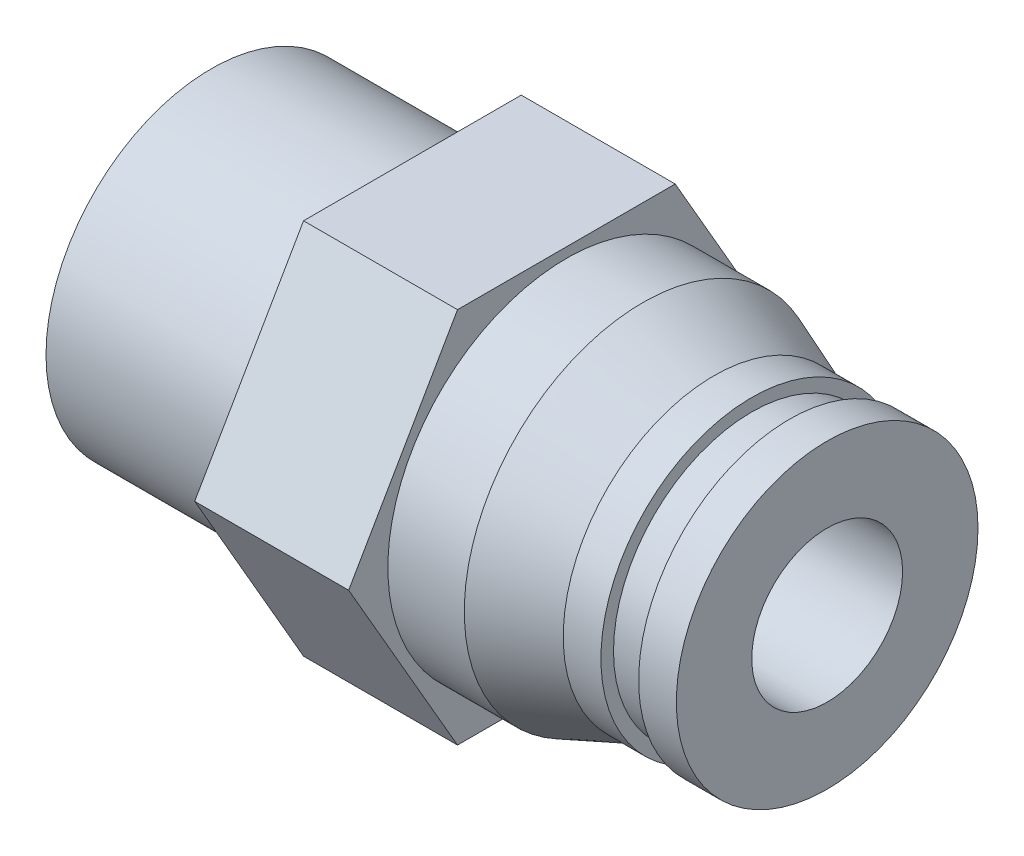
ISO-10303-21;
HEADER;
FILE_DESCRIPTION(('STEP AP214'),'2;1');
FILE_NAME('part.step','',(''),(''),'','','');
FILE_SCHEMA(('AUTOMOTIVE_DESIGN { 1 0 10303 214 1 1 1 1 }'));
ENDSEC;
DATA;
#1=APPLICATION_CONTEXT('core data for automotive mechanical design processes');
#2=APPLICATION_PROTOCOL_DEFINITION('international standard','automotive_design',2000,#1);
#3=PRODUCT_CONTEXT('',#1,'mechanical');
#4=PRODUCT('Part','Part','',(#3));
#5=PRODUCT_RELATED_PRODUCT_CATEGORY('part','',(#4));
#6=PRODUCT_DEFINITION_FORMATION('','',#4);
#7=PRODUCT_DEFINITION_CONTEXT('part definition',#1,'design');
#8=PRODUCT_DEFINITION('design','',#6,#7);
#9=PRODUCT_DEFINITION_SHAPE('','',#8);
#10=(LENGTH_UNIT() NAMED_UNIT(*) SI_UNIT(.MILLI.,.METRE.));
#11=(NAMED_UNIT(*) PLANE_ANGLE_UNIT() SI_UNIT($,.RADIAN.));
#12=(NAMED_UNIT(*) SI_UNIT($,.STERADIAN.) SOLID_ANGLE_UNIT());
#13=UNCERTAINTY_MEASURE_WITH_UNIT(LENGTH_MEASURE(1.E-05),#10,'distance_accuracy_value','');
#14=(GEOMETRIC_REPRESENTATION_CONTEXT(3) GLOBAL_UNCERTAINTY_ASSIGNED_CONTEXT((#13)) GLOBAL_UNIT_ASSIGNED_CONTEXT((#10,
#11,#12)) REPRESENTATION_CONTEXT('',''));
#15=CARTESIAN_POINT('',(0.,0.,0.));
#16=DIRECTION('',(0.,0.,1.));
#17=DIRECTION('',(1.,0.,0.));
#18=AXIS2_PLACEMENT_3D('',#15,#16,#17);
#19=CARTESIAN_POINT('',(8.,6.575,0.));
#20=DIRECTION('',(-1.,0.,0.));
#21=DIRECTION('',(0.,0.,1.));
#22=AXIS2_PLACEMENT_3D('',#19,#20,#21);
#23=PLANE('',#22);
#24=CARTESIAN_POINT('',(8.,0.,0.));
#25=DIRECTION('',(1.,0.,0.));
#26=DIRECTION('',(0.,0.,-1.));
#27=AXIS2_PLACEMENT_3D('',#24,#25,#26);
#28=CIRCLE('',#27,6.575);
#29=CARTESIAN_POINT('',(8.,0.,-6.575));
#30=VERTEX_POINT('',#29);
#31=EDGE_CURVE('E215',#30,#30,#28,.T.);
#32=ORIENTED_EDGE('',*,*,#31,.T.);
#33=EDGE_LOOP('',(#32));
#34=FACE_BOUND('',#33,.T.);
#35=DIRECTION('',(0.,-0.866025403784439,0.5));
#36=VECTOR('',#35,1.);
#37=CARTESIAN_POINT('',(8.,0.,-8.66025403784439));
#38=LINE('',#37,#36);
#39=CARTESIAN_POINT('',(8.,0.,-8.66025403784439));
#40=VERTEX_POINT('',#39);
#41=CARTESIAN_POINT('',(8.,-7.5,-4.33012701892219));
#42=VERTEX_POINT('',#41);
#43=EDGE_CURVE('E121',#40,#42,#38,.T.);
#44=ORIENTED_EDGE('',*,*,#43,.T.);
#45=DIRECTION('',(0.,0.,1.));
#46=VECTOR('',#45,1.);
#47=CARTESIAN_POINT('',(8.,-7.5,-4.33012701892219));
#48=LINE('',#47,#46);
#49=CARTESIAN_POINT('',(8.,-7.5,4.3301270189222));
#50=VERTEX_POINT('',#49);
#51=EDGE_CURVE('E106',#42,#50,#48,.T.);
#52=ORIENTED_EDGE('',*,*,#51,.T.);
#53=DIRECTION('',(0.,0.866025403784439,0.5));
#54=VECTOR('',#53,1.);
#55=CARTESIAN_POINT('',(8.,-7.5,4.3301270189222));
#56=LINE('',#55,#54);
#57=CARTESIAN_POINT('',(8.,0.,8.66025403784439));
#58=VERTEX_POINT('',#57);
#59=EDGE_CURVE('E115',#50,#58,#56,.T.);
#60=ORIENTED_EDGE('',*,*,#59,.T.);
#61=DIRECTION('',(0.,0.866025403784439,-0.5));
#62=VECTOR('',#61,1.);
#63=CARTESIAN_POINT('',(8.,0.,8.66025403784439));
#64=LINE('',#63,#62);
#65=CARTESIAN_POINT('',(8.,7.5,4.33012701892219));
#66=VERTEX_POINT('',#65);
#67=EDGE_CURVE('E30',#58,#66,#64,.T.);
#68=ORIENTED_EDGE('',*,*,#67,.T.);
#69=DIRECTION('',(0.,0.,-1.));
#70=VECTOR('',#69,1.);
#71=CARTESIAN_POINT('',(8.,7.5,4.33012701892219));
#72=LINE('',#71,#70);
#73=CARTESIAN_POINT('',(8.,7.5,-4.3301270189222));
#74=VERTEX_POINT('',#73);
#75=EDGE_CURVE('E125',#66,#74,#72,.T.);
#76=ORIENTED_EDGE('',*,*,#75,.T.);
#77=DIRECTION('',(0.,-0.866025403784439,-0.5));
#78=VECTOR('',#77,1.);
#79=CARTESIAN_POINT('',(8.,7.5,-4.3301270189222));
#80=LINE('',#79,#78);
#81=EDGE_CURVE('E128',#74,#40,#80,.T.);
#82=ORIENTED_EDGE('',*,*,#81,.T.);
#83=EDGE_LOOP('',(#44,#52,#60,#68,#76,#82));
#84=FACE_BOUND('',#83,.T.);
#85=ADVANCED_FACE('F15',(#34,#84),#23,.T.);
#86=CARTESIAN_POINT('',(14.125,9.5,0.));
#87=DIRECTION('',(1.,0.,0.));
#88=DIRECTION('',(0.,0.,-1.));
#89=AXIS2_PLACEMENT_3D('',#86,#87,#88);
#90=PLANE('',#89);
#91=CARTESIAN_POINT('',(14.125,0.,0.));
#92=DIRECTION('',(1.,0.,0.));
#93=DIRECTION('',(0.,0.,-1.));
#94=AXIS2_PLACEMENT_3D('',#91,#92,#93);
#95=CIRCLE('',#94,7.1009788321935);
#96=CARTESIAN_POINT('',(14.125,0.,-7.1009788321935));
#97=VERTEX_POINT('',#96);
#98=EDGE_CURVE('E212',#97,#97,#95,.T.);
#99=ORIENTED_EDGE('',*,*,#98,.F.);
#100=EDGE_LOOP('',(#99));
#101=FACE_BOUND('',#100,.T.);
#102=DIRECTION('',(0.,0.866025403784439,0.5));
#103=VECTOR('',#102,1.);
#104=CARTESIAN_POINT('',(14.125,-7.5,4.3301270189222));
#105=LINE('',#104,#103);
#106=CARTESIAN_POINT('',(14.125,-7.5,4.3301270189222));
#107=VERTEX_POINT('',#106);
#108=CARTESIAN_POINT('',(14.125,0.,8.66025403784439));
#109=VERTEX_POINT('',#108);
#110=EDGE_CURVE('E132',#107,#109,#105,.T.);
#111=ORIENTED_EDGE('',*,*,#110,.F.);
#112=DIRECTION('',(0.,0.,1.));
#113=VECTOR('',#112,1.);
#114=CARTESIAN_POINT('',(14.125,-7.5,-4.33012701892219));
#115=LINE('',#114,#113);
#116=CARTESIAN_POINT('',(14.125,-7.5,-4.33012701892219));
#117=VERTEX_POINT('',#116);
#118=EDGE_CURVE('E38',#117,#107,#115,.T.);
#119=ORIENTED_EDGE('',*,*,#118,.F.);
#120=DIRECTION('',(0.,-0.866025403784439,0.5));
#121=VECTOR('',#120,1.);
#122=CARTESIAN_POINT('',(14.125,0.,-8.66025403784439));
#123=LINE('',#122,#121);
#124=CARTESIAN_POINT('',(14.125,0.,-8.66025403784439));
#125=VERTEX_POINT('',#124);
#126=EDGE_CURVE('E112',#125,#117,#123,.T.);
#127=ORIENTED_EDGE('',*,*,#126,.F.);
#128=DIRECTION('',(0.,-0.866025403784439,-0.5));
#129=VECTOR('',#128,1.);
#130=CARTESIAN_POINT('',(14.125,7.5,-4.3301270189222));
#131=LINE('',#130,#129);
#132=CARTESIAN_POINT('',(14.125,7.5,-4.3301270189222));
#133=VERTEX_POINT('',#132);
#134=EDGE_CURVE('E140',#133,#125,#131,.T.);
#135=ORIENTED_EDGE('',*,*,#134,.F.);
#136=DIRECTION('',(0.,0.,-1.));
#137=VECTOR('',#136,1.);
#138=CARTESIAN_POINT('',(14.125,7.5,4.33012701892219));
#139=LINE('',#138,#137);
#140=CARTESIAN_POINT('',(14.125,7.5,4.33012701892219));
#141=VERTEX_POINT('',#140);
#142=EDGE_CURVE('E137',#141,#133,#139,.T.);
#143=ORIENTED_EDGE('',*,*,#142,.F.);
#144=DIRECTION('',(0.,0.866025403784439,-0.5));
#145=VECTOR('',#144,1.);
#146=CARTESIAN_POINT('',(14.125,0.,8.66025403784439));
#147=LINE('',#146,#145);
#148=EDGE_CURVE('E134',#109,#141,#147,.T.);
#149=ORIENTED_EDGE('',*,*,#148,.F.);
#150=EDGE_LOOP('',(#111,#119,#127,#135,#143,#149));
#151=FACE_BOUND('',#150,.T.);
#152=ADVANCED_FACE('F269',(#101,#151),#90,.T.);
#153=CARTESIAN_POINT('',(0.,0.,0.));
#154=DIRECTION('',(-1.,0.,0.));
#155=DIRECTION('',(0.,0.,1.));
#156=AXIS2_PLACEMENT_3D('',#153,#154,#155);
#157=PLANE('',#156);
#158=CARTESIAN_POINT('',(0.,0.,0.));
#159=DIRECTION('',(1.,0.,0.));
#160=DIRECTION('',(0.,0.,-1.));
#161=AXIS2_PLACEMENT_3D('',#158,#159,#160);
#162=CIRCLE('',#161,6.575);
#163=CARTESIAN_POINT('',(0.,0.,-6.575));
#164=VERTEX_POINT('',#163);
#165=EDGE_CURVE('E218',#164,#164,#162,.T.);
#166=ORIENTED_EDGE('',*,*,#165,.F.);
#167=EDGE_LOOP('',(#166));
#168=FACE_BOUND('',#167,.T.);
#169=DIRECTION('',(0.,-0.866025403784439,-0.5));
#170=VECTOR('',#169,1.);
#171=CARTESIAN_POINT('',(0.,0.,2.88675134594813));
#172=LINE('',#171,#170);
#173=CARTESIAN_POINT('',(0.,0.,2.88675134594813));
#174=VERTEX_POINT('',#173);
#175=CARTESIAN_POINT('',(0.,-2.5,1.44337567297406));
#176=VERTEX_POINT('',#175);
#177=EDGE_CURVE('E169',#174,#176,#172,.T.);
#178=ORIENTED_EDGE('',*,*,#177,.T.);
#179=DIRECTION('',(0.,0.,-1.));
#180=VECTOR('',#179,1.);
#181=CARTESIAN_POINT('',(0.,-2.5,1.44337567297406));
#182=LINE('',#181,#180);
#183=CARTESIAN_POINT('',(0.,-2.5,-1.44337567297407));
#184=VERTEX_POINT('',#183);
#185=EDGE_CURVE('E147',#176,#184,#182,.T.);
#186=ORIENTED_EDGE('',*,*,#185,.T.);
#187=DIRECTION('',(0.,0.866025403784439,-0.5));
#188=VECTOR('',#187,1.);
#189=CARTESIAN_POINT('',(0.,-2.5,-1.44337567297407));
#190=LINE('',#189,#188);
#191=CARTESIAN_POINT('',(0.,0.,-2.88675134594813));
#192=VERTEX_POINT('',#191);
#193=EDGE_CURVE('E157',#184,#192,#190,.T.);
#194=ORIENTED_EDGE('',*,*,#193,.T.);
#195=DIRECTION('',(0.,0.866025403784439,0.5));
#196=VECTOR('',#195,1.);
#197=CARTESIAN_POINT('',(0.,0.,-2.88675134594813));
#198=LINE('',#197,#196);
#199=CARTESIAN_POINT('',(0.,2.5,-1.44337567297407));
#200=VERTEX_POINT('',#199);
#201=EDGE_CURVE('E160',#192,#200,#198,.T.);
#202=ORIENTED_EDGE('',*,*,#201,.T.);
#203=DIRECTION('',(0.,0.,1.));
#204=VECTOR('',#203,1.);
#205=CARTESIAN_POINT('',(0.,2.5,-1.44337567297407));
#206=LINE('',#205,#204);
#207=CARTESIAN_POINT('',(0.,2.5,1.44337567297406));
#208=VERTEX_POINT('',#207);
#209=EDGE_CURVE('E163',#200,#208,#206,.T.);
#210=ORIENTED_EDGE('',*,*,#209,.T.);
#211=DIRECTION('',(0.,-0.866025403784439,0.5));
#212=VECTOR('',#211,1.);
#213=CARTESIAN_POINT('',(0.,2.5,1.44337567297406));
#214=LINE('',#213,#212);
#215=EDGE_CURVE('E166',#208,#174,#214,.T.);
#216=ORIENTED_EDGE('',*,*,#215,.T.);
#217=EDGE_LOOP('',(#178,#186,#194,#202,#210,#216));
#218=FACE_BOUND('',#217,.T.);
#219=ADVANCED_FACE('F17',(#168,#218),#157,.T.);
#220=CARTESIAN_POINT('',(8.,3.,0.));
#221=DIRECTION('',(1.,0.,0.));
#222=DIRECTION('',(0.,0.,-1.));
#223=AXIS2_PLACEMENT_3D('',#220,#221,#222);
#224=PLANE('',#223);
#225=CARTESIAN_POINT('',(8.,0.,0.));
#226=DIRECTION('',(1.,0.,0.));
#227=DIRECTION('',(0.,0.,-1.));
#228=AXIS2_PLACEMENT_3D('',#225,#226,#227);
#229=CIRCLE('',#228,3.);
#230=CARTESIAN_POINT('',(8.,0.,-3.));
#231=VERTEX_POINT('',#230);
#232=EDGE_CURVE('E185',#231,#231,#229,.T.);
#233=ORIENTED_EDGE('',*,*,#232,.T.);
#234=EDGE_LOOP('',(#233));
#235=FACE_BOUND('',#234,.T.);
#236=DIRECTION('',(0.,-0.866025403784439,0.5));
#237=VECTOR('',#236,1.);
#238=CARTESIAN_POINT('',(8.,1.,-3.46410161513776));
#239=LINE('',#238,#237);
#240=CARTESIAN_POINT('',(8.,0.,-2.88675134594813));
#241=VERTEX_POINT('',#240);
#242=CARTESIAN_POINT('',(8.,-2.5,-1.44337567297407));
#243=VERTEX_POINT('',#242);
#244=EDGE_CURVE('E23',#241,#243,#239,.T.);
#245=ORIENTED_EDGE('',*,*,#244,.T.);
#246=DIRECTION('',(0.,0.,1.));
#247=VECTOR('',#246,1.);
#248=CARTESIAN_POINT('',(8.,-2.5,0.));
#249=LINE('',#248,#247);
#250=CARTESIAN_POINT('',(8.,-2.5,1.44337567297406));
#251=VERTEX_POINT('',#250);
#252=EDGE_CURVE('E9',#243,#251,#249,.T.);
#253=ORIENTED_EDGE('',*,*,#252,.T.);
#254=DIRECTION('',(0.,0.866025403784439,0.5));
#255=VECTOR('',#254,1.);
#256=CARTESIAN_POINT('',(8.,1.,3.46410161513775));
#257=LINE('',#256,#255);
#258=CARTESIAN_POINT('',(8.,0.,2.88675134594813));
#259=VERTEX_POINT('',#258);
#260=EDGE_CURVE('E221',#251,#259,#257,.T.);
#261=ORIENTED_EDGE('',*,*,#260,.T.);
#262=DIRECTION('',(0.,0.866025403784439,-0.5));
#263=VECTOR('',#262,1.);
#264=CARTESIAN_POINT('',(8.,3.5,0.866025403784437));
#265=LINE('',#264,#263);
#266=CARTESIAN_POINT('',(8.,2.5,1.44337567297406));
#267=VERTEX_POINT('',#266);
#268=EDGE_CURVE('E224',#259,#267,#265,.T.);
#269=ORIENTED_EDGE('',*,*,#268,.T.);
#270=DIRECTION('',(0.,0.,-1.));
#271=VECTOR('',#270,1.);
#272=CARTESIAN_POINT('',(8.,2.5,0.));
#273=LINE('',#272,#271);
#274=CARTESIAN_POINT('',(8.,2.5,-1.44337567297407));
#275=VERTEX_POINT('',#274);
#276=EDGE_CURVE('E227',#267,#275,#273,.T.);
#277=ORIENTED_EDGE('',*,*,#276,.T.);
#278=DIRECTION('',(0.,-0.866025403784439,-0.5));
#279=VECTOR('',#278,1.);
#280=CARTESIAN_POINT('',(8.,3.5,-0.866025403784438));
#281=LINE('',#280,#279);
#282=EDGE_CURVE('E230',#275,#241,#281,.T.);
#283=ORIENTED_EDGE('',*,*,#282,.T.);
#284=EDGE_LOOP('',(#245,#253,#261,#269,#277,#283));
#285=FACE_BOUND('',#284,.T.);
#286=ADVANCED_FACE('F234',(#235,#285),#224,.T.);
#287=CARTESIAN_POINT('',(0.,0.,0.));
#288=DIRECTION('',(1.,0.,0.));
#289=DIRECTION('',(0.,0.,-1.));
#290=AXIS2_PLACEMENT_3D('',#287,#288,#289);
#291=CYLINDRICAL_SURFACE('',#290,6.575);
#292=ORIENTED_EDGE('',*,*,#165,.T.);
#293=EDGE_LOOP('',(#292));
#294=FACE_BOUND('',#293,.T.);
#295=ORIENTED_EDGE('',*,*,#31,.F.);
#296=EDGE_LOOP('',(#295));
#297=FACE_BOUND('',#296,.T.);
#298=ADVANCED_FACE('F278',(#294,#297),#291,.T.);
#299=CARTESIAN_POINT('',(0.,0.,0.));
#300=DIRECTION('',(1.,0.,0.));
#301=DIRECTION('',(0.,0.,-1.));
#302=AXIS2_PLACEMENT_3D('',#299,#300,#301);
#303=CYLINDRICAL_SURFACE('',#302,7.1009788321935);
#304=ORIENTED_EDGE('',*,*,#98,.T.);
#305=EDGE_LOOP('',(#304));
#306=FACE_BOUND('',#305,.T.);
#307=CARTESIAN_POINT('',(17.1656620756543,0.,0.));
#308=DIRECTION('',(1.,0.,0.));
#309=DIRECTION('',(0.,0.,-1.));
#310=AXIS2_PLACEMENT_3D('',#307,#308,#309);
#311=CIRCLE('',#310,7.1009788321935);
#312=CARTESIAN_POINT('',(17.1656620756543,0.,-7.1009788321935));
#313=VERTEX_POINT('',#312);
#314=EDGE_CURVE('E209',#313,#313,#311,.T.);
#315=ORIENTED_EDGE('',*,*,#314,.F.);
#316=EDGE_LOOP('',(#315));
#317=FACE_BOUND('',#316,.T.);
#318=ADVANCED_FACE('F280',(#306,#317),#303,.T.);
#319=CARTESIAN_POINT('',(20.,0.,0.));
#320=DIRECTION('',(-1.,0.,0.));
#321=DIRECTION('',(0.,0.,1.));
#322=AXIS2_PLACEMENT_3D('',#319,#320,#321);
#323=CONICAL_SURFACE('',#322,6.,0.370503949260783);
#324=ORIENTED_EDGE('',*,*,#314,.T.);
#325=EDGE_LOOP('',(#324));
#326=FACE_BOUND('',#325,.T.);
#327=CARTESIAN_POINT('',(20.,0.,0.));
#328=DIRECTION('',(1.,0.,0.));
#329=DIRECTION('',(0.,0.,-1.));
#330=AXIS2_PLACEMENT_3D('',#327,#328,#329);
#331=CIRCLE('',#330,6.);
#332=CARTESIAN_POINT('',(20.,0.,-6.));
#333=VERTEX_POINT('',#332);
#334=EDGE_CURVE('E206',#333,#333,#331,.T.);
#335=ORIENTED_EDGE('',*,*,#334,.F.);
#336=EDGE_LOOP('',(#335));
#337=FACE_BOUND('',#336,.T.);
#338=ADVANCED_FACE('F286',(#326,#337),#323,.T.);
#339=CARTESIAN_POINT('',(0.,0.,0.));
#340=DIRECTION('',(1.,0.,0.));
#341=DIRECTION('',(0.,0.,-1.));
#342=AXIS2_PLACEMENT_3D('',#339,#340,#341);
#343=CYLINDRICAL_SURFACE('',#342,6.);
#344=ORIENTED_EDGE('',*,*,#334,.T.);
#345=EDGE_LOOP('',(#344));
#346=FACE_BOUND('',#345,.T.);
#347=CARTESIAN_POINT('',(21.5,0.,0.));
#348=DIRECTION('',(1.,0.,0.));
#349=DIRECTION('',(0.,0.,-1.));
#350=AXIS2_PLACEMENT_3D('',#347,#348,#349);
#351=CIRCLE('',#350,6.);
#352=CARTESIAN_POINT('',(21.5,0.,-6.));
#353=VERTEX_POINT('',#352);
#354=EDGE_CURVE('E203',#353,#353,#351,.T.);
#355=ORIENTED_EDGE('',*,*,#354,.F.);
#356=EDGE_LOOP('',(#355));
#357=FACE_BOUND('',#356,.T.);
#358=ADVANCED_FACE('F330',(#346,#357),#343,.T.);
#359=CARTESIAN_POINT('',(21.5,6.,0.));
#360=DIRECTION('',(1.,0.,0.));
#361=DIRECTION('',(0.,0.,-1.));
#362=AXIS2_PLACEMENT_3D('',#359,#360,#361);
#363=PLANE('',#362);
#364=ORIENTED_EDGE('',*,*,#354,.T.);
#365=EDGE_LOOP('',(#364));
#366=FACE_BOUND('',#365,.T.);
#367=CARTESIAN_POINT('',(21.5,0.,0.));
#368=DIRECTION('',(1.,0.,0.));
#369=DIRECTION('',(0.,0.,-1.));
#370=AXIS2_PLACEMENT_3D('',#367,#368,#369);
#371=CIRCLE('',#370,5.5);
#372=CARTESIAN_POINT('',(21.5,0.,-5.5));
#373=VERTEX_POINT('',#372);
#374=EDGE_CURVE('E200',#373,#373,#371,.T.);
#375=ORIENTED_EDGE('',*,*,#374,.F.);
#376=EDGE_LOOP('',(#375));
#377=FACE_BOUND('',#376,.T.);
#378=ADVANCED_FACE('F340',(#366,#377),#363,.T.);
#379=CARTESIAN_POINT('',(0.,0.,0.));
#380=DIRECTION('',(1.,0.,0.));
#381=DIRECTION('',(0.,0.,-1.));
#382=AXIS2_PLACEMENT_3D('',#379,#380,#381);
#383=CYLINDRICAL_SURFACE('',#382,5.5);
#384=ORIENTED_EDGE('',*,*,#374,.T.);
#385=EDGE_LOOP('',(#384));
#386=FACE_BOUND('',#385,.T.);
#387=CARTESIAN_POINT('',(23.,0.,0.));
#388=DIRECTION('',(1.,0.,0.));
#389=DIRECTION('',(0.,0.,-1.));
#390=AXIS2_PLACEMENT_3D('',#387,#388,#389);
#391=CIRCLE('',#390,5.5);
#392=CARTESIAN_POINT('',(23.,0.,-5.5));
#393=VERTEX_POINT('',#392);
#394=EDGE_CURVE('E197',#393,#393,#391,.T.);
#395=ORIENTED_EDGE('',*,*,#394,.F.);
#396=EDGE_LOOP('',(#395));
#397=FACE_BOUND('',#396,.T.);
#398=ADVANCED_FACE('F350',(#386,#397),#383,.T.);
#399=CARTESIAN_POINT('',(23.,5.5,0.));
#400=DIRECTION('',(-1.,0.,0.));
#401=DIRECTION('',(0.,0.,1.));
#402=AXIS2_PLACEMENT_3D('',#399,#400,#401);
#403=PLANE('',#402);
#404=ORIENTED_EDGE('',*,*,#394,.T.);
#405=EDGE_LOOP('',(#404));
#406=FACE_BOUND('',#405,.T.);
#407=CARTESIAN_POINT('',(23.,0.,0.));
#408=DIRECTION('',(1.,0.,0.));
#409=DIRECTION('',(0.,0.,-1.));
#410=AXIS2_PLACEMENT_3D('',#407,#408,#409);
#411=CIRCLE('',#410,6.);
#412=CARTESIAN_POINT('',(23.,0.,-6.));
#413=VERTEX_POINT('',#412);
#414=EDGE_CURVE('E194',#413,#413,#411,.T.);
#415=ORIENTED_EDGE('',*,*,#414,.F.);
#416=EDGE_LOOP('',(#415));
#417=FACE_BOUND('',#416,.T.);
#418=ADVANCED_FACE('F361',(#406,#417),#403,.T.);
#419=CARTESIAN_POINT('',(0.,0.,0.));
#420=DIRECTION('',(1.,0.,0.));
#421=DIRECTION('',(0.,0.,-1.));
#422=AXIS2_PLACEMENT_3D('',#419,#420,#421);
#423=CYLINDRICAL_SURFACE('',#422,6.);
#424=ORIENTED_EDGE('',*,*,#414,.T.);
#425=EDGE_LOOP('',(#424));
#426=FACE_BOUND('',#425,.T.);
#427=CARTESIAN_POINT('',(24.5,0.,0.));
#428=DIRECTION('',(1.,0.,0.));
#429=DIRECTION('',(0.,0.,-1.));
#430=AXIS2_PLACEMENT_3D('',#427,#428,#429);
#431=CIRCLE('',#430,6.);
#432=CARTESIAN_POINT('',(24.5,0.,-6.));
#433=VERTEX_POINT('',#432);
#434=EDGE_CURVE('E191',#433,#433,#431,.T.);
#435=ORIENTED_EDGE('',*,*,#434,.F.);
#436=EDGE_LOOP('',(#435));
#437=FACE_BOUND('',#436,.T.);
#438=ADVANCED_FACE('F375',(#426,#437),#423,.T.);
#439=CARTESIAN_POINT('',(24.5,6.,0.));
#440=DIRECTION('',(1.,0.,0.));
#441=DIRECTION('',(0.,0.,-1.));
#442=AXIS2_PLACEMENT_3D('',#439,#440,#441);
#443=PLANE('',#442);
#444=ORIENTED_EDGE('',*,*,#434,.T.);
#445=EDGE_LOOP('',(#444));
#446=FACE_BOUND('',#445,.T.);
#447=CARTESIAN_POINT('',(24.5,0.,0.));
#448=DIRECTION('',(1.,0.,0.));
#449=DIRECTION('',(0.,0.,-1.));
#450=AXIS2_PLACEMENT_3D('',#447,#448,#449);
#451=CIRCLE('',#450,3.);
#452=CARTESIAN_POINT('',(24.5,0.,-3.));
#453=VERTEX_POINT('',#452);
#454=EDGE_CURVE('E188',#453,#453,#451,.T.);
#455=ORIENTED_EDGE('',*,*,#454,.F.);
#456=EDGE_LOOP('',(#455));
#457=FACE_BOUND('',#456,.T.);
#458=ADVANCED_FACE('F385',(#446,#457),#443,.T.);
#459=CARTESIAN_POINT('',(0.,0.,0.));
#460=DIRECTION('',(1.,0.,0.));
#461=DIRECTION('',(0.,0.,-1.));
#462=AXIS2_PLACEMENT_3D('',#459,#460,#461);
#463=CYLINDRICAL_SURFACE('',#462,3.);
#464=ORIENTED_EDGE('',*,*,#454,.T.);
#465=EDGE_LOOP('',(#464));
#466=FACE_BOUND('',#465,.T.);
#467=ORIENTED_EDGE('',*,*,#232,.F.);
#468=EDGE_LOOP('',(#467));
#469=FACE_BOUND('',#468,.T.);
#470=ADVANCED_FACE('F396',(#466,#469),#463,.F.);
#471=CARTESIAN_POINT('',(24.5,-2.5,1.44337567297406));
#472=DIRECTION('',(0.,1.,0.));
#473=DIRECTION('',(0.,0.,1.));
#474=AXIS2_PLACEMENT_3D('',#471,#472,#473);
#475=PLANE('',#474);
#476=DIRECTION('',(-1.,0.,0.));
#477=VECTOR('',#476,1.);
#478=CARTESIAN_POINT('',(24.5,-2.5,-1.44337567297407));
#479=LINE('',#478,#477);
#480=EDGE_CURVE('E183',#243,#184,#479,.T.);
#481=ORIENTED_EDGE('',*,*,#480,.T.);
#482=ORIENTED_EDGE('',*,*,#185,.F.);
#483=DIRECTION('',(-1.,0.,0.));
#484=VECTOR('',#483,1.);
#485=CARTESIAN_POINT('',(24.5,-2.5,1.44337567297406));
#486=LINE('',#485,#484);
#487=EDGE_CURVE('E172',#251,#176,#486,.T.);
#488=ORIENTED_EDGE('',*,*,#487,.F.);
#489=ORIENTED_EDGE('',*,*,#252,.F.);
#490=EDGE_LOOP('',(#481,#482,#488,#489));
#491=FACE_BOUND('',#490,.T.);
#492=ADVANCED_FACE('F249',(#491),#475,.T.);
#493=CARTESIAN_POINT('',(24.5,-2.5,-1.44337567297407));
#494=DIRECTION('',(0.,0.5,0.866025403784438));
#495=DIRECTION('',(0.,-0.866025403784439,0.5));
#496=AXIS2_PLACEMENT_3D('',#493,#494,#495);
#497=PLANE('',#496);
#498=DIRECTION('',(-1.,0.,0.));
#499=VECTOR('',#498,1.);
#500=CARTESIAN_POINT('',(24.5,0.,-2.88675134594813));
#501=LINE('',#500,#499);
#502=EDGE_CURVE('E181',#241,#192,#501,.T.);
#503=ORIENTED_EDGE('',*,*,#502,.T.);
#504=ORIENTED_EDGE('',*,*,#193,.F.);
#505=ORIENTED_EDGE('',*,*,#480,.F.);
#506=ORIENTED_EDGE('',*,*,#244,.F.);
#507=EDGE_LOOP('',(#503,#504,#505,#506));
#508=FACE_BOUND('',#507,.T.);
#509=ADVANCED_FACE('F238',(#508),#497,.T.);
#510=CARTESIAN_POINT('',(24.5,0.,-2.88675134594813));
#511=DIRECTION('',(0.,-0.5,0.866025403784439));
#512=DIRECTION('',(0.,-0.866025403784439,-0.5));
#513=AXIS2_PLACEMENT_3D('',#510,#511,#512);
#514=PLANE('',#513);
#515=DIRECTION('',(-1.,0.,0.));
#516=VECTOR('',#515,1.);
#517=CARTESIAN_POINT('',(24.5,2.5,-1.44337567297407));
#518=LINE('',#517,#516);
#519=EDGE_CURVE('E179',#275,#200,#518,.T.);
#520=ORIENTED_EDGE('',*,*,#519,.T.);
#521=ORIENTED_EDGE('',*,*,#201,.F.);
#522=ORIENTED_EDGE('',*,*,#502,.F.);
#523=ORIENTED_EDGE('',*,*,#282,.F.);
#524=EDGE_LOOP('',(#520,#521,#522,#523));
#525=FACE_BOUND('',#524,.T.);
#526=ADVANCED_FACE('F242',(#525),#514,.T.);
#527=CARTESIAN_POINT('',(24.5,2.5,-1.44337567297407));
#528=DIRECTION('',(0.,-1.,0.));
#529=DIRECTION('',(0.,0.,-1.));
#530=AXIS2_PLACEMENT_3D('',#527,#528,#529);
#531=PLANE('',#530);
#532=DIRECTION('',(-1.,0.,0.));
#533=VECTOR('',#532,1.);
#534=CARTESIAN_POINT('',(24.5,2.5,1.44337567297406));
#535=LINE('',#534,#533);
#536=EDGE_CURVE('E177',#267,#208,#535,.T.);
#537=ORIENTED_EDGE('',*,*,#536,.T.);
#538=ORIENTED_EDGE('',*,*,#209,.F.);
#539=ORIENTED_EDGE('',*,*,#519,.F.);
#540=ORIENTED_EDGE('',*,*,#276,.F.);
#541=EDGE_LOOP('',(#537,#538,#539,#540));
#542=FACE_BOUND('',#541,.T.);
#543=ADVANCED_FACE('F258',(#542),#531,.T.);
#544=CARTESIAN_POINT('',(24.5,2.5,1.44337567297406));
#545=DIRECTION('',(0.,-0.5,-0.866025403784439));
#546=DIRECTION('',(0.,0.866025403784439,-0.5));
#547=AXIS2_PLACEMENT_3D('',#544,#545,#546);
#548=PLANE('',#547);
#549=DIRECTION('',(-1.,0.,0.));
#550=VECTOR('',#549,1.);
#551=CARTESIAN_POINT('',(24.5,0.,2.88675134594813));
#552=LINE('',#551,#550);
#553=EDGE_CURVE('E175',#259,#174,#552,.T.);
#554=ORIENTED_EDGE('',*,*,#553,.T.);
#555=ORIENTED_EDGE('',*,*,#215,.F.);
#556=ORIENTED_EDGE('',*,*,#536,.F.);
#557=ORIENTED_EDGE('',*,*,#268,.F.);
#558=EDGE_LOOP('',(#554,#555,#556,#557));
#559=FACE_BOUND('',#558,.T.);
#560=ADVANCED_FACE('F255',(#559),#548,.T.);
#561=CARTESIAN_POINT('',(24.5,0.,2.88675134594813));
#562=DIRECTION('',(0.,0.5,-0.866025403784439));
#563=DIRECTION('',(0.,0.866025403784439,0.5));
#564=AXIS2_PLACEMENT_3D('',#561,#562,#563);
#565=PLANE('',#564);
#566=ORIENTED_EDGE('',*,*,#487,.T.);
#567=ORIENTED_EDGE('',*,*,#177,.F.);
#568=ORIENTED_EDGE('',*,*,#553,.F.);
#569=ORIENTED_EDGE('',*,*,#260,.F.);
#570=EDGE_LOOP('',(#566,#567,#568,#569));
#571=FACE_BOUND('',#570,.T.);
#572=ADVANCED_FACE('F251',(#571),#565,.T.);
#573=CARTESIAN_POINT('',(14.125,-7.5,-4.33012701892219));
#574=DIRECTION('',(0.,-1.,0.));
#575=DIRECTION('',(0.,0.,-1.));
#576=AXIS2_PLACEMENT_3D('',#573,#574,#575);
#577=PLANE('',#576);
#578=DIRECTION('',(-1.,0.,0.));
#579=VECTOR('',#578,1.);
#580=CARTESIAN_POINT('',(14.125,-7.5,-4.33012701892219));
#581=LINE('',#580,#579);
#582=EDGE_CURVE('E145',#117,#42,#581,.T.);
#583=ORIENTED_EDGE('',*,*,#582,.F.);
#584=ORIENTED_EDGE('',*,*,#118,.T.);
#585=DIRECTION('',(-1.,0.,0.));
#586=VECTOR('',#585,1.);
#587=CARTESIAN_POINT('',(14.125,-7.5,4.3301270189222));
#588=LINE('',#587,#586);
#589=EDGE_CURVE('E102',#107,#50,#588,.T.);
#590=ORIENTED_EDGE('',*,*,#589,.T.);
#591=ORIENTED_EDGE('',*,*,#51,.F.);
#592=EDGE_LOOP('',(#583,#584,#590,#591));
#593=FACE_BOUND('',#592,.T.);
#594=ADVANCED_FACE('F104',(#593),#577,.T.);
#595=CARTESIAN_POINT('',(14.125,0.,-8.66025403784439));
#596=DIRECTION('',(0.,-0.5,-0.866025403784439));
#597=DIRECTION('',(0.,0.866025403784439,-0.5));
#598=AXIS2_PLACEMENT_3D('',#595,#596,#597);
#599=PLANE('',#598);
#600=DIRECTION('',(-1.,0.,0.));
#601=VECTOR('',#600,1.);
#602=CARTESIAN_POINT('',(14.125,0.,-8.66025403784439));
#603=LINE('',#602,#601);
#604=EDGE_CURVE('E148',#125,#40,#603,.T.);
#605=ORIENTED_EDGE('',*,*,#604,.F.);
#606=ORIENTED_EDGE('',*,*,#126,.T.);
#607=ORIENTED_EDGE('',*,*,#582,.T.);
#608=ORIENTED_EDGE('',*,*,#43,.F.);
#609=EDGE_LOOP('',(#605,#606,#607,#608));
#610=FACE_BOUND('',#609,.T.);
#611=ADVANCED_FACE('F457',(#610),#599,.T.);
#612=CARTESIAN_POINT('',(14.125,7.5,-4.3301270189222));
#613=DIRECTION('',(0.,0.5,-0.866025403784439));
#614=DIRECTION('',(0.,0.866025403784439,0.5));
#615=AXIS2_PLACEMENT_3D('',#612,#613,#614);
#616=PLANE('',#615);
#617=DIRECTION('',(-1.,0.,0.));
#618=VECTOR('',#617,1.);
#619=CARTESIAN_POINT('',(14.125,7.5,-4.3301270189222));
#620=LINE('',#619,#618);
#621=EDGE_CURVE('E150',#133,#74,#620,.T.);
#622=ORIENTED_EDGE('',*,*,#621,.F.);
#623=ORIENTED_EDGE('',*,*,#134,.T.);
#624=ORIENTED_EDGE('',*,*,#604,.T.);
#625=ORIENTED_EDGE('',*,*,#81,.F.);
#626=EDGE_LOOP('',(#622,#623,#624,#625));
#627=FACE_BOUND('',#626,.T.);
#628=ADVANCED_FACE('F466',(#627),#616,.T.);
#629=CARTESIAN_POINT('',(14.125,7.5,4.33012701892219));
#630=DIRECTION('',(0.,1.,0.));
#631=DIRECTION('',(0.,0.,1.));
#632=AXIS2_PLACEMENT_3D('',#629,#630,#631);
#633=PLANE('',#632);
#634=DIRECTION('',(-1.,0.,0.));
#635=VECTOR('',#634,1.);
#636=CARTESIAN_POINT('',(14.125,7.5,4.33012701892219));
#637=LINE('',#636,#635);
#638=EDGE_CURVE('E152',#141,#66,#637,.T.);
#639=ORIENTED_EDGE('',*,*,#638,.F.);
#640=ORIENTED_EDGE('',*,*,#142,.T.);
#641=ORIENTED_EDGE('',*,*,#621,.T.);
#642=ORIENTED_EDGE('',*,*,#75,.F.);
#643=EDGE_LOOP('',(#639,#640,#641,#642));
#644=FACE_BOUND('',#643,.T.);
#645=ADVANCED_FACE('F476',(#644),#633,.T.);
#646=CARTESIAN_POINT('',(14.125,0.,8.66025403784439));
#647=DIRECTION('',(0.,0.5,0.866025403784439));
#648=DIRECTION('',(0.,-0.866025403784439,0.5));
#649=AXIS2_PLACEMENT_3D('',#646,#647,#648);
#650=PLANE('',#649);
#651=DIRECTION('',(-1.,0.,0.));
#652=VECTOR('',#651,1.);
#653=CARTESIAN_POINT('',(14.125,0.,8.66025403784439));
#654=LINE('',#653,#652);
#655=EDGE_CURVE('E111',#109,#58,#654,.T.);
#656=ORIENTED_EDGE('',*,*,#655,.F.);
#657=ORIENTED_EDGE('',*,*,#148,.T.);
#658=ORIENTED_EDGE('',*,*,#638,.T.);
#659=ORIENTED_EDGE('',*,*,#67,.F.);
#660=EDGE_LOOP('',(#656,#657,#658,#659));
#661=FACE_BOUND('',#660,.T.);
#662=ADVANCED_FACE('F486',(#661),#650,.T.);
#663=CARTESIAN_POINT('',(14.125,-7.5,4.3301270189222));
#664=DIRECTION('',(0.,-0.5,0.866025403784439));
#665=DIRECTION('',(0.,-0.866025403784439,-0.5));
#666=AXIS2_PLACEMENT_3D('',#663,#664,#665);
#667=PLANE('',#666);
#668=ORIENTED_EDGE('',*,*,#589,.F.);
#669=ORIENTED_EDGE('',*,*,#110,.T.);
#670=ORIENTED_EDGE('',*,*,#655,.T.);
#671=ORIENTED_EDGE('',*,*,#59,.F.);
#672=EDGE_LOOP('',(#668,#669,#670,#671));
#673=FACE_BOUND('',#672,.T.);
#674=ADVANCED_FACE('F116',(#673),#667,.T.);
#675=CLOSED_SHELL('',(#85,#152,#219,#286,#298,#318,#338,#358,#378,#398,#418,#438,#458,#470,#492,
#509,#526,#543,#560,#572,#594,#611,#628,#645,#662,#674));
#676=MANIFOLD_SOLID_BREP('B1',#675);
#677=ADVANCED_BREP_SHAPE_REPRESENTATION('',(#18,#676),#14);
#678=SHAPE_DEFINITION_REPRESENTATION(#9,#677);
ENDSEC;
END-ISO-10303-21;
